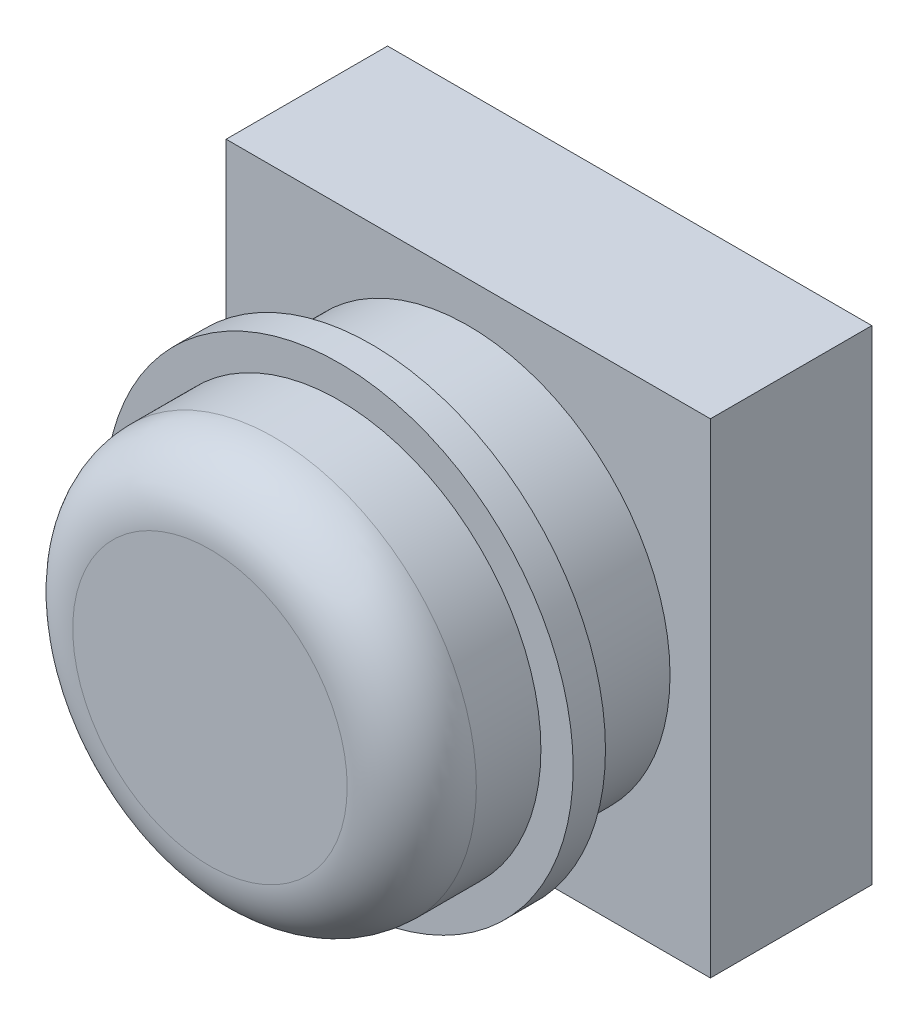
from build123d import *

# Parameters (mm, degrees)
SKETCH1_W           = 15
SKETCH1_H           = 15
BASE_EXTRUDE_DEPTH  = 5
SKETCH2_R           = 6.25
BOSS_EXTRUDE1_DEPTH = 8
FILLET2_R           = 2
SKETCH4_R           = 7.25
SKETCH4_R_2         = 6.25
BOSS_EXTRUDE2_DEPTH = 1


with BuildPart() as part:
    # Sketch1 → Base-Extrude (new body)
    with BuildSketch(Plane.XY):
        Rectangle(SKETCH1_W, SKETCH1_H)
    extrude(amount=BASE_EXTRUDE_DEPTH)

    # Sketch2 → Boss-Extrude1 (add)
    with BuildSketch(Plane.XY.offset(5)):
        Circle(SKETCH2_R)
    extrude(amount=BOSS_EXTRUDE1_DEPTH)

    # Fillet2
    fillet2_edges = [part.edges().sort_by_distance(p)[0] for p in [
        (-6.25, 0, 13),
    ]]
    fillet(fillet2_edges, radius=FILLET2_R)

    # Sketch4 → Boss-Extrude2 (add)
    with BuildSketch(Plane.XY.offset(8)):
        Circle(SKETCH4_R)
        Circle(SKETCH4_R_2, mode=Mode.SUBTRACT)
    extrude(amount=BOSS_EXTRUDE2_DEPTH)


solid = part.part
